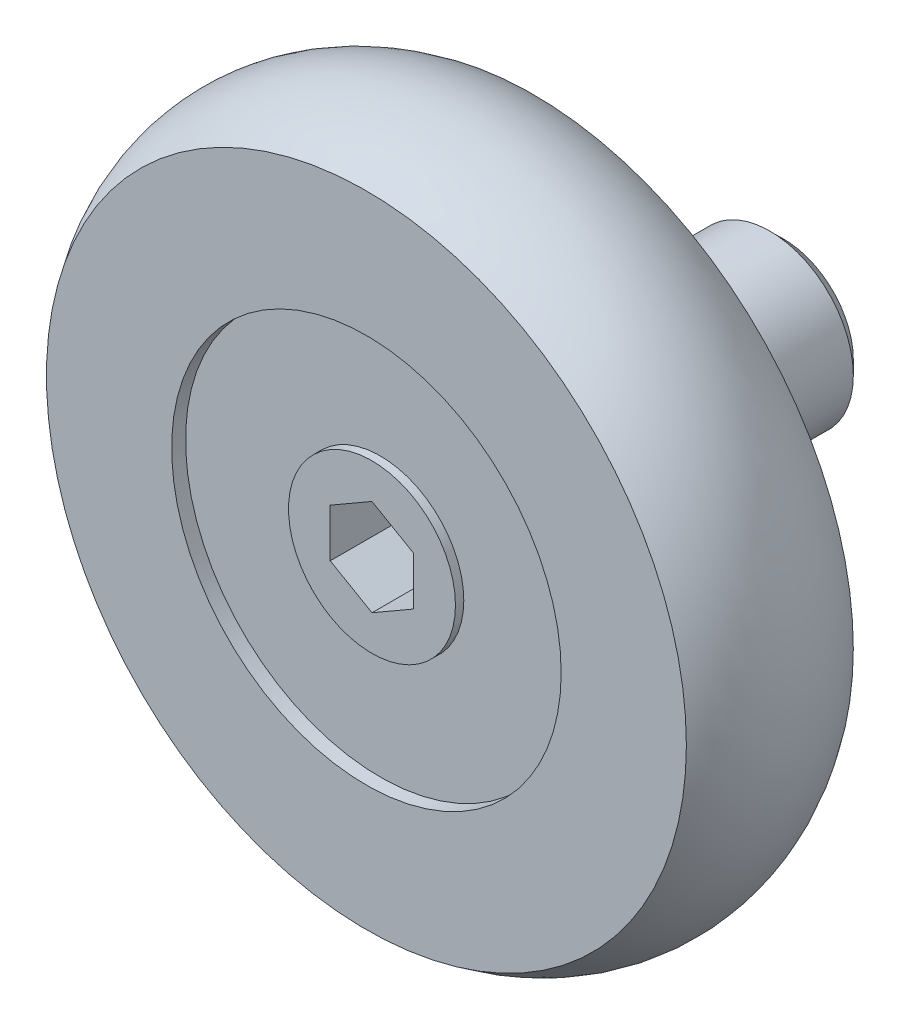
ISO-10303-21;
HEADER;
FILE_DESCRIPTION(('STEP AP214'),'2;1');
FILE_NAME('part.step','',(''),(''),'','','');
FILE_SCHEMA(('AUTOMOTIVE_DESIGN { 1 0 10303 214 1 1 1 1 }'));
ENDSEC;
DATA;
#1=APPLICATION_CONTEXT('core data for automotive mechanical design processes');
#2=APPLICATION_PROTOCOL_DEFINITION('international standard','automotive_design',2000,#1);
#3=PRODUCT_CONTEXT('',#1,'mechanical');
#4=PRODUCT('Part','Part','',(#3));
#5=PRODUCT_RELATED_PRODUCT_CATEGORY('part','',(#4));
#6=PRODUCT_DEFINITION_FORMATION('','',#4);
#7=PRODUCT_DEFINITION_CONTEXT('part definition',#1,'design');
#8=PRODUCT_DEFINITION('design','',#6,#7);
#9=PRODUCT_DEFINITION_SHAPE('','',#8);
#10=(LENGTH_UNIT() NAMED_UNIT(*) SI_UNIT(.MILLI.,.METRE.));
#11=(NAMED_UNIT(*) PLANE_ANGLE_UNIT() SI_UNIT($,.RADIAN.));
#12=(NAMED_UNIT(*) SI_UNIT($,.STERADIAN.) SOLID_ANGLE_UNIT());
#13=UNCERTAINTY_MEASURE_WITH_UNIT(LENGTH_MEASURE(1.E-05),#10,'distance_accuracy_value','');
#14=(GEOMETRIC_REPRESENTATION_CONTEXT(3) GLOBAL_UNCERTAINTY_ASSIGNED_CONTEXT((#13)) GLOBAL_UNIT_ASSIGNED_CONTEXT((#10,
#11,#12)) REPRESENTATION_CONTEXT('',''));
#15=CARTESIAN_POINT('',(0.,0.,0.));
#16=DIRECTION('',(0.,0.,1.));
#17=DIRECTION('',(1.,0.,0.));
#18=AXIS2_PLACEMENT_3D('',#15,#16,#17);
#19=CARTESIAN_POINT('',(0.,0.,-8.));
#20=DIRECTION('',(0.,0.,1.));
#21=DIRECTION('',(1.,0.,0.));
#22=AXIS2_PLACEMENT_3D('',#19,#20,#21);
#23=PLANE('',#22);
#24=CARTESIAN_POINT('',(0.,0.,-8.));
#25=DIRECTION('',(0.,0.,1.));
#26=DIRECTION('',(1.,0.,0.));
#27=AXIS2_PLACEMENT_3D('',#24,#25,#26);
#28=CIRCLE('',#27,2.5);
#29=CARTESIAN_POINT('',(2.5,0.,-8.));
#30=VERTEX_POINT('',#29);
#31=EDGE_CURVE('E9',#30,#30,#28,.T.);
#32=ORIENTED_EDGE('',*,*,#31,.F.);
#33=EDGE_LOOP('',(#32));
#34=FACE_BOUND('',#33,.T.);
#35=ADVANCED_FACE('F14',(#34),#23,.F.);
#36=CARTESIAN_POINT('',(0.,0.,-8.));
#37=DIRECTION('',(0.,0.,1.));
#38=DIRECTION('',(1.,0.,0.));
#39=AXIS2_PLACEMENT_3D('',#36,#37,#38);
#40=CONICAL_SURFACE('',#39,2.5,0.785398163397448);
#41=CARTESIAN_POINT('',(0.,0.,-7.5));
#42=DIRECTION('',(0.,0.,1.));
#43=DIRECTION('',(1.,0.,0.));
#44=AXIS2_PLACEMENT_3D('',#41,#42,#43);
#45=CIRCLE('',#44,3.);
#46=CARTESIAN_POINT('',(3.,0.,-7.5));
#47=VERTEX_POINT('',#46);
#48=EDGE_CURVE('E21',#47,#47,#45,.T.);
#49=ORIENTED_EDGE('',*,*,#48,.F.);
#50=EDGE_LOOP('',(#49));
#51=FACE_BOUND('',#50,.T.);
#52=ORIENTED_EDGE('',*,*,#31,.T.);
#53=EDGE_LOOP('',(#52));
#54=FACE_BOUND('',#53,.T.);
#55=ADVANCED_FACE('F163',(#51,#54),#40,.T.);
#56=CARTESIAN_POINT('',(0.,0.,10.));
#57=DIRECTION('',(0.,0.,1.));
#58=DIRECTION('',(1.,0.,0.));
#59=AXIS2_PLACEMENT_3D('',#56,#57,#58);
#60=CYLINDRICAL_SURFACE('',#59,3.);
#61=CARTESIAN_POINT('',(0.,0.,-2.));
#62=DIRECTION('',(0.,0.,1.));
#63=DIRECTION('',(1.,0.,0.));
#64=AXIS2_PLACEMENT_3D('',#61,#62,#63);
#65=CIRCLE('',#64,3.);
#66=CARTESIAN_POINT('',(3.,0.,-2.));
#67=VERTEX_POINT('',#66);
#68=EDGE_CURVE('E156',#67,#67,#65,.T.);
#69=ORIENTED_EDGE('',*,*,#68,.F.);
#70=EDGE_LOOP('',(#69));
#71=FACE_BOUND('',#70,.T.);
#72=ORIENTED_EDGE('',*,*,#48,.T.);
#73=EDGE_LOOP('',(#72));
#74=FACE_BOUND('',#73,.T.);
#75=ADVANCED_FACE('F161',(#71,#74),#60,.T.);
#76=CARTESIAN_POINT('',(0.,2.35,-2.));
#77=DIRECTION('',(0.,0.,-1.));
#78=DIRECTION('',(-1.,0.,0.));
#79=AXIS2_PLACEMENT_3D('',#76,#77,#78);
#80=PLANE('',#79);
#81=CARTESIAN_POINT('',(0.,0.,-2.));
#82=DIRECTION('',(0.,0.,1.));
#83=DIRECTION('',(1.,0.,0.));
#84=AXIS2_PLACEMENT_3D('',#81,#82,#83);
#85=CIRCLE('',#84,2.35);
#86=CARTESIAN_POINT('',(2.35,0.,-2.));
#87=VERTEX_POINT('',#86);
#88=EDGE_CURVE('E153',#87,#87,#85,.T.);
#89=ORIENTED_EDGE('',*,*,#88,.F.);
#90=EDGE_LOOP('',(#89));
#91=FACE_BOUND('',#90,.T.);
#92=ORIENTED_EDGE('',*,*,#68,.T.);
#93=EDGE_LOOP('',(#92));
#94=FACE_BOUND('',#93,.T.);
#95=ADVANCED_FACE('F188',(#91,#94),#80,.F.);
#96=CARTESIAN_POINT('',(0.,0.,10.));
#97=DIRECTION('',(0.,0.,1.));
#98=DIRECTION('',(1.,0.,0.));
#99=AXIS2_PLACEMENT_3D('',#96,#97,#98);
#100=CYLINDRICAL_SURFACE('',#99,2.35);
#101=CARTESIAN_POINT('',(0.,0.,0.));
#102=DIRECTION('',(0.,0.,1.));
#103=DIRECTION('',(1.,0.,0.));
#104=AXIS2_PLACEMENT_3D('',#101,#102,#103);
#105=CIRCLE('',#104,2.35);
#106=CARTESIAN_POINT('',(2.35,0.,0.));
#107=VERTEX_POINT('',#106);
#108=EDGE_CURVE('E150',#107,#107,#105,.T.);
#109=ORIENTED_EDGE('',*,*,#108,.F.);
#110=EDGE_LOOP('',(#109));
#111=FACE_BOUND('',#110,.T.);
#112=ORIENTED_EDGE('',*,*,#88,.T.);
#113=EDGE_LOOP('',(#112));
#114=FACE_BOUND('',#113,.T.);
#115=ADVANCED_FACE('F197',(#111,#114),#100,.T.);
#116=CARTESIAN_POINT('',(0.,4.,0.));
#117=DIRECTION('',(0.,0.,1.));
#118=DIRECTION('',(1.,0.,0.));
#119=AXIS2_PLACEMENT_3D('',#116,#117,#118);
#120=PLANE('',#119);
#121=CARTESIAN_POINT('',(0.,0.,0.));
#122=DIRECTION('',(0.,0.,1.));
#123=DIRECTION('',(1.,0.,0.));
#124=AXIS2_PLACEMENT_3D('',#121,#122,#123);
#125=CIRCLE('',#124,4.);
#126=CARTESIAN_POINT('',(4.,0.,0.));
#127=VERTEX_POINT('',#126);
#128=EDGE_CURVE('E147',#127,#127,#125,.T.);
#129=ORIENTED_EDGE('',*,*,#128,.F.);
#130=EDGE_LOOP('',(#129));
#131=FACE_BOUND('',#130,.T.);
#132=ORIENTED_EDGE('',*,*,#108,.T.);
#133=EDGE_LOOP('',(#132));
#134=FACE_BOUND('',#133,.T.);
#135=ADVANCED_FACE('F206',(#131,#134),#120,.F.);
#136=CARTESIAN_POINT('',(0.,0.,10.));
#137=DIRECTION('',(0.,0.,1.));
#138=DIRECTION('',(1.,0.,0.));
#139=AXIS2_PLACEMENT_3D('',#136,#137,#138);
#140=CYLINDRICAL_SURFACE('',#139,4.);
#141=CARTESIAN_POINT('',(0.,0.,1.5));
#142=DIRECTION('',(0.,0.,1.));
#143=DIRECTION('',(1.,0.,0.));
#144=AXIS2_PLACEMENT_3D('',#141,#142,#143);
#145=CIRCLE('',#144,4.);
#146=CARTESIAN_POINT('',(4.,0.,1.5));
#147=VERTEX_POINT('',#146);
#148=EDGE_CURVE('E144',#147,#147,#145,.T.);
#149=ORIENTED_EDGE('',*,*,#148,.F.);
#150=EDGE_LOOP('',(#149));
#151=FACE_BOUND('',#150,.T.);
#152=ORIENTED_EDGE('',*,*,#128,.T.);
#153=EDGE_LOOP('',(#152));
#154=FACE_BOUND('',#153,.T.);
#155=ADVANCED_FACE('F215',(#151,#154),#140,.T.);
#156=CARTESIAN_POINT('',(0.,4.,1.5));
#157=DIRECTION('',(0.,0.,1.));
#158=DIRECTION('',(1.,0.,0.));
#159=AXIS2_PLACEMENT_3D('',#156,#157,#158);
#160=PLANE('',#159);
#161=CARTESIAN_POINT('',(0.,0.,1.5));
#162=DIRECTION('',(0.,0.,1.));
#163=DIRECTION('',(1.,0.,0.));
#164=AXIS2_PLACEMENT_3D('',#161,#162,#163);
#165=CIRCLE('',#164,7.);
#166=CARTESIAN_POINT('',(7.,0.,1.5));
#167=VERTEX_POINT('',#166);
#168=EDGE_CURVE('E141',#167,#167,#165,.T.);
#169=ORIENTED_EDGE('',*,*,#168,.F.);
#170=EDGE_LOOP('',(#169));
#171=FACE_BOUND('',#170,.T.);
#172=ORIENTED_EDGE('',*,*,#148,.T.);
#173=EDGE_LOOP('',(#172));
#174=FACE_BOUND('',#173,.T.);
#175=ADVANCED_FACE('F224',(#171,#174),#160,.F.);
#176=CARTESIAN_POINT('',(0.,0.,10.));
#177=DIRECTION('',(0.,0.,1.));
#178=DIRECTION('',(1.,0.,0.));
#179=AXIS2_PLACEMENT_3D('',#176,#177,#178);
#180=CYLINDRICAL_SURFACE('',#179,7.);
#181=CARTESIAN_POINT('',(0.,0.,1.));
#182=DIRECTION('',(0.,0.,1.));
#183=DIRECTION('',(1.,0.,0.));
#184=AXIS2_PLACEMENT_3D('',#181,#182,#183);
#185=CIRCLE('',#184,7.);
#186=CARTESIAN_POINT('',(7.,0.,1.));
#187=VERTEX_POINT('',#186);
#188=EDGE_CURVE('E138',#187,#187,#185,.T.);
#189=ORIENTED_EDGE('',*,*,#188,.F.);
#190=EDGE_LOOP('',(#189));
#191=FACE_BOUND('',#190,.T.);
#192=ORIENTED_EDGE('',*,*,#168,.T.);
#193=EDGE_LOOP('',(#192));
#194=FACE_BOUND('',#193,.T.);
#195=ADVANCED_FACE('F233',(#191,#194),#180,.F.);
#196=CARTESIAN_POINT('',(0.,11.5,1.));
#197=DIRECTION('',(0.,0.,1.));
#198=DIRECTION('',(1.,0.,0.));
#199=AXIS2_PLACEMENT_3D('',#196,#197,#198);
#200=PLANE('',#199);
#201=CARTESIAN_POINT('',(0.,0.,1.));
#202=DIRECTION('',(0.,0.,1.));
#203=DIRECTION('',(1.,0.,0.));
#204=AXIS2_PLACEMENT_3D('',#201,#202,#203);
#205=CIRCLE('',#204,11.5);
#206=CARTESIAN_POINT('',(11.5,0.,1.));
#207=VERTEX_POINT('',#206);
#208=EDGE_CURVE('E135',#207,#207,#205,.T.);
#209=ORIENTED_EDGE('',*,*,#208,.F.);
#210=EDGE_LOOP('',(#209));
#211=FACE_BOUND('',#210,.T.);
#212=ORIENTED_EDGE('',*,*,#188,.T.);
#213=EDGE_LOOP('',(#212));
#214=FACE_BOUND('',#213,.T.);
#215=ADVANCED_FACE('F242',(#211,#214),#200,.F.);
#216=CARTESIAN_POINT('',(0.,0.,4.));
#217=DIRECTION('',(0.,0.,1.));
#218=DIRECTION('',(1.,0.,0.));
#219=AXIS2_PLACEMENT_3D('',#216,#217,#218);
#220=TOROIDAL_SURFACE('',#219,7.5,5.);
#221=CARTESIAN_POINT('',(0.,0.,7.));
#222=DIRECTION('',(0.,0.,1.));
#223=DIRECTION('',(1.,0.,0.));
#224=AXIS2_PLACEMENT_3D('',#221,#222,#223);
#225=CIRCLE('',#224,11.5);
#226=CARTESIAN_POINT('',(11.5,0.,7.));
#227=VERTEX_POINT('',#226);
#228=EDGE_CURVE('E132',#227,#227,#225,.T.);
#229=ORIENTED_EDGE('',*,*,#228,.F.);
#230=EDGE_LOOP('',(#229));
#231=FACE_BOUND('',#230,.T.);
#232=ORIENTED_EDGE('',*,*,#208,.T.);
#233=EDGE_LOOP('',(#232));
#234=FACE_BOUND('',#233,.T.);
#235=ADVANCED_FACE('F251',(#231,#234),#220,.T.);
#236=CARTESIAN_POINT('',(0.,11.5,7.));
#237=DIRECTION('',(0.,0.,-1.));
#238=DIRECTION('',(-1.,0.,0.));
#239=AXIS2_PLACEMENT_3D('',#236,#237,#238);
#240=PLANE('',#239);
#241=CARTESIAN_POINT('',(0.,0.,7.));
#242=DIRECTION('',(0.,0.,1.));
#243=DIRECTION('',(1.,0.,0.));
#244=AXIS2_PLACEMENT_3D('',#241,#242,#243);
#245=CIRCLE('',#244,7.);
#246=CARTESIAN_POINT('',(7.,0.,7.));
#247=VERTEX_POINT('',#246);
#248=EDGE_CURVE('E129',#247,#247,#245,.T.);
#249=ORIENTED_EDGE('',*,*,#248,.F.);
#250=EDGE_LOOP('',(#249));
#251=FACE_BOUND('',#250,.T.);
#252=ORIENTED_EDGE('',*,*,#228,.T.);
#253=EDGE_LOOP('',(#252));
#254=FACE_BOUND('',#253,.T.);
#255=ADVANCED_FACE('F260',(#251,#254),#240,.F.);
#256=CARTESIAN_POINT('',(0.,0.,10.));
#257=DIRECTION('',(0.,0.,1.));
#258=DIRECTION('',(1.,0.,0.));
#259=AXIS2_PLACEMENT_3D('',#256,#257,#258);
#260=CYLINDRICAL_SURFACE('',#259,7.);
#261=CARTESIAN_POINT('',(0.,0.,6.5));
#262=DIRECTION('',(0.,0.,1.));
#263=DIRECTION('',(1.,0.,0.));
#264=AXIS2_PLACEMENT_3D('',#261,#262,#263);
#265=CIRCLE('',#264,7.);
#266=CARTESIAN_POINT('',(7.,0.,6.5));
#267=VERTEX_POINT('',#266);
#268=EDGE_CURVE('E126',#267,#267,#265,.T.);
#269=ORIENTED_EDGE('',*,*,#268,.F.);
#270=EDGE_LOOP('',(#269));
#271=FACE_BOUND('',#270,.T.);
#272=ORIENTED_EDGE('',*,*,#248,.T.);
#273=EDGE_LOOP('',(#272));
#274=FACE_BOUND('',#273,.T.);
#275=ADVANCED_FACE('F269',(#271,#274),#260,.F.);
#276=CARTESIAN_POINT('',(0.,3.,6.5));
#277=DIRECTION('',(0.,0.,-1.));
#278=DIRECTION('',(-1.,0.,0.));
#279=AXIS2_PLACEMENT_3D('',#276,#277,#278);
#280=PLANE('',#279);
#281=CARTESIAN_POINT('',(0.,0.,6.5));
#282=DIRECTION('',(0.,0.,1.));
#283=DIRECTION('',(1.,0.,0.));
#284=AXIS2_PLACEMENT_3D('',#281,#282,#283);
#285=CIRCLE('',#284,3.);
#286=CARTESIAN_POINT('',(3.,0.,6.5));
#287=VERTEX_POINT('',#286);
#288=EDGE_CURVE('E123',#287,#287,#285,.T.);
#289=ORIENTED_EDGE('',*,*,#288,.F.);
#290=EDGE_LOOP('',(#289));
#291=FACE_BOUND('',#290,.T.);
#292=ORIENTED_EDGE('',*,*,#268,.T.);
#293=EDGE_LOOP('',(#292));
#294=FACE_BOUND('',#293,.T.);
#295=ADVANCED_FACE('F278',(#291,#294),#280,.F.);
#296=CARTESIAN_POINT('',(0.,0.,10.));
#297=DIRECTION('',(0.,0.,1.));
#298=DIRECTION('',(1.,0.,0.));
#299=AXIS2_PLACEMENT_3D('',#296,#297,#298);
#300=CYLINDRICAL_SURFACE('',#299,3.);
#301=CARTESIAN_POINT('',(0.,0.,6.8));
#302=DIRECTION('',(0.,0.,1.));
#303=DIRECTION('',(1.,0.,0.));
#304=AXIS2_PLACEMENT_3D('',#301,#302,#303);
#305=CIRCLE('',#304,3.);
#306=CARTESIAN_POINT('',(3.,0.,6.8));
#307=VERTEX_POINT('',#306);
#308=EDGE_CURVE('E115',#307,#307,#305,.T.);
#309=ORIENTED_EDGE('',*,*,#308,.F.);
#310=EDGE_LOOP('',(#309));
#311=FACE_BOUND('',#310,.T.);
#312=ORIENTED_EDGE('',*,*,#288,.T.);
#313=EDGE_LOOP('',(#312));
#314=FACE_BOUND('',#313,.T.);
#315=ADVANCED_FACE('F287',(#311,#314),#300,.T.);
#316=CARTESIAN_POINT('',(0.,3.,6.8));
#317=DIRECTION('',(0.,0.,-1.));
#318=DIRECTION('',(-1.,0.,0.));
#319=AXIS2_PLACEMENT_3D('',#316,#317,#318);
#320=PLANE('',#319);
#321=DIRECTION('',(-0.866025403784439,-0.5,0.));
#322=VECTOR('',#321,1.);
#323=CARTESIAN_POINT('',(0.,1.73205080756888,6.8));
#324=LINE('',#323,#322);
#325=CARTESIAN_POINT('',(0.,1.73205080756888,6.8));
#326=VERTEX_POINT('',#325);
#327=CARTESIAN_POINT('',(-1.5,0.866025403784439,6.8));
#328=VERTEX_POINT('',#327);
#329=EDGE_CURVE('E102',#326,#328,#324,.T.);
#330=ORIENTED_EDGE('',*,*,#329,.F.);
#331=DIRECTION('',(-0.866025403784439,0.5,0.));
#332=VECTOR('',#331,1.);
#333=CARTESIAN_POINT('',(1.5,0.86602540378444,6.8));
#334=LINE('',#333,#332);
#335=CARTESIAN_POINT('',(1.5,0.86602540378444,6.8));
#336=VERTEX_POINT('',#335);
#337=EDGE_CURVE('E28',#336,#326,#334,.T.);
#338=ORIENTED_EDGE('',*,*,#337,.F.);
#339=DIRECTION('',(0.,1.,0.));
#340=VECTOR('',#339,1.);
#341=CARTESIAN_POINT('',(1.5,-0.866025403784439,6.8));
#342=LINE('',#341,#340);
#343=CARTESIAN_POINT('',(1.5,-0.866025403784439,6.8));
#344=VERTEX_POINT('',#343);
#345=EDGE_CURVE('E111',#344,#336,#342,.T.);
#346=ORIENTED_EDGE('',*,*,#345,.F.);
#347=DIRECTION('',(0.866025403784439,0.5,0.));
#348=VECTOR('',#347,1.);
#349=CARTESIAN_POINT('',(0.,-1.73205080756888,6.8));
#350=LINE('',#349,#348);
#351=CARTESIAN_POINT('',(0.,-1.73205080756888,6.8));
#352=VERTEX_POINT('',#351);
#353=EDGE_CURVE('E109',#352,#344,#350,.T.);
#354=ORIENTED_EDGE('',*,*,#353,.F.);
#355=DIRECTION('',(0.866025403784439,-0.5,0.));
#356=VECTOR('',#355,1.);
#357=CARTESIAN_POINT('',(-1.5,-0.866025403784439,6.8));
#358=LINE('',#357,#356);
#359=CARTESIAN_POINT('',(-1.5,-0.866025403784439,6.8));
#360=VERTEX_POINT('',#359);
#361=EDGE_CURVE('E76',#360,#352,#358,.T.);
#362=ORIENTED_EDGE('',*,*,#361,.F.);
#363=DIRECTION('',(0.,-1.,0.));
#364=VECTOR('',#363,1.);
#365=CARTESIAN_POINT('',(-1.5,0.866025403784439,6.8));
#366=LINE('',#365,#364);
#367=EDGE_CURVE('E105',#328,#360,#366,.T.);
#368=ORIENTED_EDGE('',*,*,#367,.F.);
#369=EDGE_LOOP('',(#330,#338,#346,#354,#362,#368));
#370=FACE_BOUND('',#369,.T.);
#371=ORIENTED_EDGE('',*,*,#308,.T.);
#372=EDGE_LOOP('',(#371));
#373=FACE_BOUND('',#372,.T.);
#374=ADVANCED_FACE('F296',(#370,#373),#320,.F.);
#375=CARTESIAN_POINT('',(1.5,0.86602540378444,4.3));
#376=DIRECTION('',(0.5,0.866025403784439,0.));
#377=DIRECTION('',(-0.866025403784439,0.5,0.));
#378=AXIS2_PLACEMENT_3D('',#375,#376,#377);
#379=PLANE('',#378);
#380=ORIENTED_EDGE('',*,*,#337,.T.);
#381=DIRECTION('',(0.,0.,1.));
#382=VECTOR('',#381,1.);
#383=CARTESIAN_POINT('',(0.,1.73205080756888,4.3));
#384=LINE('',#383,#382);
#385=CARTESIAN_POINT('',(0.,1.73205080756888,4.3));
#386=VERTEX_POINT('',#385);
#387=EDGE_CURVE('E58',#386,#326,#384,.T.);
#388=ORIENTED_EDGE('',*,*,#387,.F.);
#389=DIRECTION('',(-0.866025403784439,0.5,0.));
#390=VECTOR('',#389,1.);
#391=CARTESIAN_POINT('',(1.5,0.86602540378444,4.3));
#392=LINE('',#391,#390);
#393=CARTESIAN_POINT('',(1.5,0.86602540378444,4.3));
#394=VERTEX_POINT('',#393);
#395=EDGE_CURVE('E113',#394,#386,#392,.T.);
#396=ORIENTED_EDGE('',*,*,#395,.F.);
#397=DIRECTION('',(0.,0.,1.));
#398=VECTOR('',#397,1.);
#399=CARTESIAN_POINT('',(1.5,0.86602540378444,4.3));
#400=LINE('',#399,#398);
#401=EDGE_CURVE('E36',#394,#336,#400,.T.);
#402=ORIENTED_EDGE('',*,*,#401,.T.);
#403=EDGE_LOOP('',(#380,#388,#396,#402));
#404=FACE_BOUND('',#403,.T.);
#405=ADVANCED_FACE('F305',(#404),#379,.F.);
#406=CARTESIAN_POINT('',(1.5,-0.866025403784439,4.3));
#407=DIRECTION('',(1.,0.,0.));
#408=DIRECTION('',(0.,1.,0.));
#409=AXIS2_PLACEMENT_3D('',#406,#407,#408);
#410=PLANE('',#409);
#411=ORIENTED_EDGE('',*,*,#345,.T.);
#412=ORIENTED_EDGE('',*,*,#401,.F.);
#413=DIRECTION('',(0.,1.,0.));
#414=VECTOR('',#413,1.);
#415=CARTESIAN_POINT('',(1.5,-0.866025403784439,4.3));
#416=LINE('',#415,#414);
#417=CARTESIAN_POINT('',(1.5,-0.866025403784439,4.3));
#418=VERTEX_POINT('',#417);
#419=EDGE_CURVE('E88',#418,#394,#416,.T.);
#420=ORIENTED_EDGE('',*,*,#419,.F.);
#421=DIRECTION('',(0.,0.,1.));
#422=VECTOR('',#421,1.);
#423=CARTESIAN_POINT('',(1.5,-0.866025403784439,4.3));
#424=LINE('',#423,#422);
#425=EDGE_CURVE('E80',#418,#344,#424,.T.);
#426=ORIENTED_EDGE('',*,*,#425,.T.);
#427=EDGE_LOOP('',(#411,#412,#420,#426));
#428=FACE_BOUND('',#427,.T.);
#429=ADVANCED_FACE('F314',(#428),#410,.F.);
#430=CARTESIAN_POINT('',(0.,-1.73205080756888,4.3));
#431=DIRECTION('',(0.5,-0.866025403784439,0.));
#432=DIRECTION('',(0.866025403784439,0.5,0.));
#433=AXIS2_PLACEMENT_3D('',#430,#431,#432);
#434=PLANE('',#433);
#435=ORIENTED_EDGE('',*,*,#353,.T.);
#436=ORIENTED_EDGE('',*,*,#425,.F.);
#437=DIRECTION('',(0.866025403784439,0.5,0.));
#438=VECTOR('',#437,1.);
#439=CARTESIAN_POINT('',(0.,-1.73205080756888,4.3));
#440=LINE('',#439,#438);
#441=CARTESIAN_POINT('',(0.,-1.73205080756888,4.3));
#442=VERTEX_POINT('',#441);
#443=EDGE_CURVE('E84',#442,#418,#440,.T.);
#444=ORIENTED_EDGE('',*,*,#443,.F.);
#445=DIRECTION('',(0.,0.,1.));
#446=VECTOR('',#445,1.);
#447=CARTESIAN_POINT('',(0.,-1.73205080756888,4.3));
#448=LINE('',#447,#446);
#449=EDGE_CURVE('E69',#442,#352,#448,.T.);
#450=ORIENTED_EDGE('',*,*,#449,.T.);
#451=EDGE_LOOP('',(#435,#436,#444,#450));
#452=FACE_BOUND('',#451,.T.);
#453=ADVANCED_FACE('F85',(#452),#434,.F.);
#454=CARTESIAN_POINT('',(-1.5,-0.866025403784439,4.3));
#455=DIRECTION('',(-0.5,-0.866025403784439,0.));
#456=DIRECTION('',(0.866025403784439,-0.5,0.));
#457=AXIS2_PLACEMENT_3D('',#454,#455,#456);
#458=PLANE('',#457);
#459=ORIENTED_EDGE('',*,*,#361,.T.);
#460=ORIENTED_EDGE('',*,*,#449,.F.);
#461=DIRECTION('',(0.866025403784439,-0.5,0.));
#462=VECTOR('',#461,1.);
#463=CARTESIAN_POINT('',(-1.5,-0.866025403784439,4.3));
#464=LINE('',#463,#462);
#465=CARTESIAN_POINT('',(-1.5,-0.866025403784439,4.3));
#466=VERTEX_POINT('',#465);
#467=EDGE_CURVE('E73',#466,#442,#464,.T.);
#468=ORIENTED_EDGE('',*,*,#467,.F.);
#469=DIRECTION('',(0.,0.,1.));
#470=VECTOR('',#469,1.);
#471=CARTESIAN_POINT('',(-1.5,-0.866025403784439,4.3));
#472=LINE('',#471,#470);
#473=EDGE_CURVE('E81',#466,#360,#472,.T.);
#474=ORIENTED_EDGE('',*,*,#473,.T.);
#475=EDGE_LOOP('',(#459,#460,#468,#474));
#476=FACE_BOUND('',#475,.T.);
#477=ADVANCED_FACE('F71',(#476),#458,.F.);
#478=CARTESIAN_POINT('',(-1.5,0.866025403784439,4.3));
#479=DIRECTION('',(-1.,0.,0.));
#480=DIRECTION('',(0.,-1.,0.));
#481=AXIS2_PLACEMENT_3D('',#478,#479,#480);
#482=PLANE('',#481);
#483=ORIENTED_EDGE('',*,*,#367,.T.);
#484=ORIENTED_EDGE('',*,*,#473,.F.);
#485=DIRECTION('',(0.,-1.,0.));
#486=VECTOR('',#485,1.);
#487=CARTESIAN_POINT('',(-1.5,0.866025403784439,4.3));
#488=LINE('',#487,#486);
#489=CARTESIAN_POINT('',(-1.5,0.866025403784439,4.3));
#490=VERTEX_POINT('',#489);
#491=EDGE_CURVE('E94',#490,#466,#488,.T.);
#492=ORIENTED_EDGE('',*,*,#491,.F.);
#493=DIRECTION('',(0.,0.,1.));
#494=VECTOR('',#493,1.);
#495=CARTESIAN_POINT('',(-1.5,0.866025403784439,4.3));
#496=LINE('',#495,#494);
#497=EDGE_CURVE('E118',#490,#328,#496,.T.);
#498=ORIENTED_EDGE('',*,*,#497,.T.);
#499=EDGE_LOOP('',(#483,#484,#492,#498));
#500=FACE_BOUND('',#499,.T.);
#501=ADVANCED_FACE('F336',(#500),#482,.F.);
#502=CARTESIAN_POINT('',(0.,1.73205080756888,4.3));
#503=DIRECTION('',(-0.5,0.866025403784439,0.));
#504=DIRECTION('',(-0.866025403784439,-0.5,0.));
#505=AXIS2_PLACEMENT_3D('',#502,#503,#504);
#506=PLANE('',#505);
#507=ORIENTED_EDGE('',*,*,#329,.T.);
#508=ORIENTED_EDGE('',*,*,#497,.F.);
#509=DIRECTION('',(-0.866025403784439,-0.5,0.));
#510=VECTOR('',#509,1.);
#511=CARTESIAN_POINT('',(0.,1.73205080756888,4.3));
#512=LINE('',#511,#510);
#513=EDGE_CURVE('E96',#386,#490,#512,.T.);
#514=ORIENTED_EDGE('',*,*,#513,.F.);
#515=ORIENTED_EDGE('',*,*,#387,.T.);
#516=EDGE_LOOP('',(#507,#508,#514,#515));
#517=FACE_BOUND('',#516,.T.);
#518=ADVANCED_FACE('F344',(#517),#506,.F.);
#519=CARTESIAN_POINT('',(0.,0.,4.3));
#520=DIRECTION('',(0.,0.,1.));
#521=DIRECTION('',(1.,0.,0.));
#522=AXIS2_PLACEMENT_3D('',#519,#520,#521);
#523=PLANE('',#522);
#524=ORIENTED_EDGE('',*,*,#395,.T.);
#525=ORIENTED_EDGE('',*,*,#513,.T.);
#526=ORIENTED_EDGE('',*,*,#491,.T.);
#527=ORIENTED_EDGE('',*,*,#467,.T.);
#528=ORIENTED_EDGE('',*,*,#443,.T.);
#529=ORIENTED_EDGE('',*,*,#419,.T.);
#530=EDGE_LOOP('',(#524,#525,#526,#527,#528,#529));
#531=FACE_BOUND('',#530,.T.);
#532=ADVANCED_FACE('F91',(#531),#523,.T.);
#533=CLOSED_SHELL('',(#35,#55,#75,#95,#115,#135,#155,#175,#195,#215,#235,#255,#275,#295,#315,
#374,#405,#429,#453,#477,#501,#518,#532));
#534=MANIFOLD_SOLID_BREP('B1',#533);
#535=ADVANCED_BREP_SHAPE_REPRESENTATION('',(#18,#534),#14);
#536=SHAPE_DEFINITION_REPRESENTATION(#9,#535);
ENDSEC;
END-ISO-10303-21;
